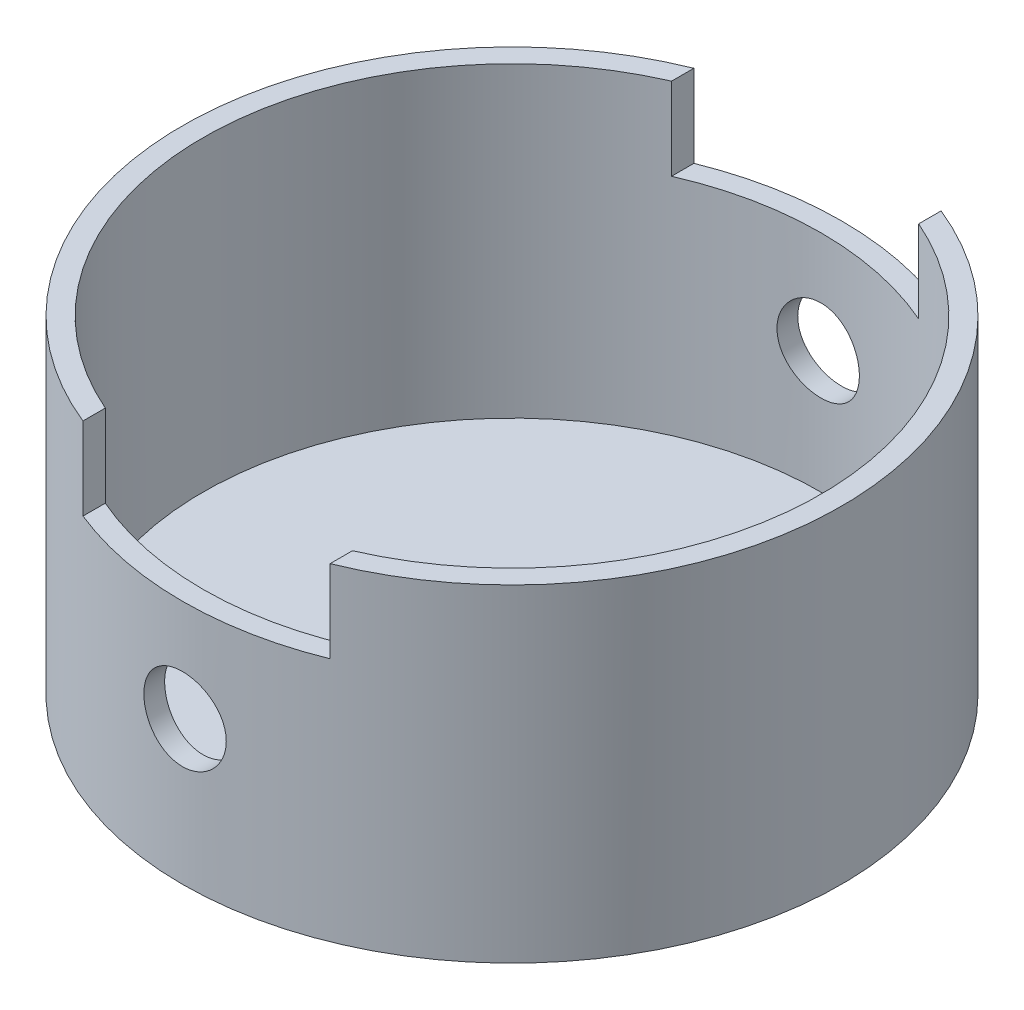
ISO-10303-21;
HEADER;
FILE_DESCRIPTION(('STEP AP214'),'2;1');
FILE_NAME('part.step','',(''),(''),'','','');
FILE_SCHEMA(('AUTOMOTIVE_DESIGN { 1 0 10303 214 1 1 1 1 }'));
ENDSEC;
DATA;
#1=APPLICATION_CONTEXT('core data for automotive mechanical design processes');
#2=APPLICATION_PROTOCOL_DEFINITION('international standard','automotive_design',2000,#1);
#3=PRODUCT_CONTEXT('',#1,'mechanical');
#4=PRODUCT('Part','Part','',(#3));
#5=PRODUCT_RELATED_PRODUCT_CATEGORY('part','',(#4));
#6=PRODUCT_DEFINITION_FORMATION('','',#4);
#7=PRODUCT_DEFINITION_CONTEXT('part definition',#1,'design');
#8=PRODUCT_DEFINITION('design','',#6,#7);
#9=PRODUCT_DEFINITION_SHAPE('','',#8);
#10=(LENGTH_UNIT() NAMED_UNIT(*) SI_UNIT(.MILLI.,.METRE.));
#11=(NAMED_UNIT(*) PLANE_ANGLE_UNIT() SI_UNIT($,.RADIAN.));
#12=(NAMED_UNIT(*) SI_UNIT($,.STERADIAN.) SOLID_ANGLE_UNIT());
#13=UNCERTAINTY_MEASURE_WITH_UNIT(LENGTH_MEASURE(1.E-05),#10,'distance_accuracy_value','');
#14=(GEOMETRIC_REPRESENTATION_CONTEXT(3) GLOBAL_UNCERTAINTY_ASSIGNED_CONTEXT((#13)) GLOBAL_UNIT_ASSIGNED_CONTEXT((#10,
#11,#12)) REPRESENTATION_CONTEXT('',''));
#15=CARTESIAN_POINT('',(0.,0.,0.));
#16=DIRECTION('',(0.,0.,1.));
#17=DIRECTION('',(1.,0.,0.));
#18=AXIS2_PLACEMENT_3D('',#15,#16,#17);
#19=CARTESIAN_POINT('',(0.,50.4952,0.));
#20=DIRECTION('',(0.,1.,0.));
#21=DIRECTION('',(0.,0.,1.));
#22=AXIS2_PLACEMENT_3D('',#19,#20,#21);
#23=PLANE('',#22);
#24=DIRECTION('',(0.,0.,1.));
#25=VECTOR('',#24,1.);
#26=CARTESIAN_POINT('',(-19.05,50.4952,-50.8));
#27=LINE('',#26,#25);
#28=CARTESIAN_POINT('',(-19.05,50.4952,-47.0928603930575));
#29=VERTEX_POINT('',#28);
#30=CARTESIAN_POINT('',(-19.05,50.4952,-43.6490334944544));
#31=VERTEX_POINT('',#30);
#32=EDGE_CURVE('E120',#29,#31,#27,.T.);
#33=ORIENTED_EDGE('',*,*,#32,.F.);
#34=CARTESIAN_POINT('',(0.,50.4952,0.));
#35=DIRECTION('',(0.,1.,0.));
#36=DIRECTION('',(0.,0.,1.));
#37=AXIS2_PLACEMENT_3D('',#34,#35,#36);
#38=CIRCLE('',#37,50.8);
#39=CARTESIAN_POINT('',(-19.05,50.4952,47.0928603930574));
#40=VERTEX_POINT('',#39);
#41=EDGE_CURVE('E158',#29,#40,#38,.T.);
#42=ORIENTED_EDGE('',*,*,#41,.T.);
#43=CARTESIAN_POINT('',(-19.05,50.4952,43.6490334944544));
#44=VERTEX_POINT('',#43);
#45=EDGE_CURVE('E198',#44,#40,#27,.T.);
#46=ORIENTED_EDGE('',*,*,#45,.F.);
#47=CARTESIAN_POINT('',(0.,50.4952,0.));
#48=DIRECTION('',(0.,1.,0.));
#49=DIRECTION('',(0.,0.,1.));
#50=AXIS2_PLACEMENT_3D('',#47,#48,#49);
#51=CIRCLE('',#50,47.625);
#52=EDGE_CURVE('E153',#31,#44,#51,.T.);
#53=ORIENTED_EDGE('',*,*,#52,.F.);
#54=EDGE_LOOP('',(#33,#42,#46,#53));
#55=FACE_BOUND('',#54,.T.);
#56=ADVANCED_FACE('F39',(#55),#23,.T.);
#57=CARTESIAN_POINT('',(0.,50.4952,0.));
#58=DIRECTION('',(0.,-1.,0.));
#59=DIRECTION('',(0.,0.,-1.));
#60=AXIS2_PLACEMENT_3D('',#57,#58,#59);
#61=CYLINDRICAL_SURFACE('',#60,50.8);
#62=CARTESIAN_POINT('',(0.,28.4226,-50.8));
#63=CARTESIAN_POINT('',(-0.177660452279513,28.4226020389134,-50.800000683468));
#64=CARTESIAN_POINT('',(-0.355290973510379,28.4151414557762,-50.7990661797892));
#65=CARTESIAN_POINT('',(-0.709338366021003,28.3853564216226,-50.7953557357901));
#66=CARTESIAN_POINT('',(-0.885754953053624,28.3630286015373,-50.7925793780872));
#67=CARTESIAN_POINT('',(-1.23618570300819,28.3036476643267,-50.7852595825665));
#68=CARTESIAN_POINT('',(-1.4101979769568,28.2665835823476,-50.780714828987));
#69=CARTESIAN_POINT('',(-1.75451712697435,28.1779895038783,-50.7699847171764));
#70=CARTESIAN_POINT('',(-1.92482262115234,28.1264542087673,-50.7637987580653));
#71=CARTESIAN_POINT('',(-2.26028082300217,28.0093633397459,-50.7499683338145));
#72=CARTESIAN_POINT('',(-2.42543874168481,27.943822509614,-50.7423254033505));
#73=CARTESIAN_POINT('',(-2.74969172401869,27.7991369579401,-50.7257879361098));
#74=CARTESIAN_POINT('',(-2.90878452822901,27.7199872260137,-50.7168929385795));
#75=CARTESIAN_POINT('',(-3.21964998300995,27.5487144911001,-50.6981073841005));
#76=CARTESIAN_POINT('',(-3.37142659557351,27.4565986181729,-50.6882173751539));
#77=CARTESIAN_POINT('',(-3.66675816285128,27.2599757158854,-50.667709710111));
#78=CARTESIAN_POINT('',(-3.81031004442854,27.1554640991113,-50.6570917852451));
#79=CARTESIAN_POINT('',(-4.08877364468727,26.9343061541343,-50.6353782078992));
#80=CARTESIAN_POINT('',(-4.22364310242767,26.8176068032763,-50.6242806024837));
#81=CARTESIAN_POINT('',(-4.48313482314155,26.5732418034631,-50.601961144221));
#82=CARTESIAN_POINT('',(-4.60775327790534,26.4455721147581,-50.5907392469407));
#83=CARTESIAN_POINT('',(-4.84578010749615,26.1802355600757,-50.5684951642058));
#84=CARTESIAN_POINT('',(-4.95919202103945,26.0425718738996,-50.5574729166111));
#85=CARTESIAN_POINT('',(-5.17409430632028,25.7581168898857,-50.5359319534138));
#86=CARTESIAN_POINT('',(-5.27558026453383,25.6113222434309,-50.5254134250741));
#87=CARTESIAN_POINT('',(-5.46614935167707,25.309218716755,-50.5051524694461));
#88=CARTESIAN_POINT('',(-5.55519426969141,25.1538855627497,-50.4954124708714));
#89=CARTESIAN_POINT('',(-5.71990676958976,24.8361494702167,-50.4770198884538));
#90=CARTESIAN_POINT('',(-5.79556937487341,24.6737439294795,-50.4683677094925));
#91=CARTESIAN_POINT('',(-5.93289692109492,24.3431168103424,-50.4524085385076));
#92=CARTESIAN_POINT('',(-5.99456744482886,24.1748975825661,-50.4451010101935));
#93=CARTESIAN_POINT('',(-6.10351153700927,23.8337833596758,-50.4320345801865));
#94=CARTESIAN_POINT('',(-6.15077981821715,23.6608866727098,-50.4262762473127));
#95=CARTESIAN_POINT('',(-6.26991974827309,23.1389812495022,-50.4116539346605));
#96=CARTESIAN_POINT('',(-6.32000152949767,22.7846432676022,-50.4053374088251));
#97=CARTESIAN_POINT('',(-6.36001442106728,22.0727333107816,-50.4003032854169));
#98=CARTESIAN_POINT('',(-6.34994795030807,21.7151614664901,-50.4015853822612));
#99=CARTESIAN_POINT('',(-6.2702829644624,21.0088500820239,-50.411557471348));
#100=CARTESIAN_POINT('',(-6.20102456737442,20.6600717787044,-50.4202051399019));
#101=CARTESIAN_POINT('',(-6.00545126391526,19.9791408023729,-50.4438714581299));
#102=CARTESIAN_POINT('',(-5.87913520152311,19.646988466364,-50.4588902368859));
#103=CARTESIAN_POINT('',(-5.57267217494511,19.007664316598,-50.4936536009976));
#104=CARTESIAN_POINT('',(-5.39237737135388,18.7005640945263,-50.5134111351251));
#105=CARTESIAN_POINT('',(-4.98317902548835,18.1208507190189,-50.555416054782));
#106=CARTESIAN_POINT('',(-4.75427325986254,17.8482391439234,-50.5776635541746));
#107=CARTESIAN_POINT('',(-4.25246571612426,17.3432655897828,-50.6223297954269));
#108=CARTESIAN_POINT('',(-3.97927069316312,17.1111949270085,-50.6447486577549));
#109=CARTESIAN_POINT('',(-3.39764921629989,16.6961594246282,-50.6870876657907));
#110=CARTESIAN_POINT('',(-3.08922268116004,16.5131946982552,-50.7070078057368));
#111=CARTESIAN_POINT('',(-2.44566864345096,16.2015644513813,-50.7421172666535));
#112=CARTESIAN_POINT('',(-2.1105322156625,16.0729171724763,-50.7573049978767));
#113=CARTESIAN_POINT('',(-1.42318216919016,15.8738049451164,-50.7812239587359));
#114=CARTESIAN_POINT('',(-1.07096935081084,15.8033372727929,-50.7899554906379));
#115=CARTESIAN_POINT('',(-0.361983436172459,15.7229621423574,-50.7999389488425));
#116=CARTESIAN_POINT('',(-0.00525650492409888,15.7126533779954,-50.8012404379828));
#117=CARTESIAN_POINT('',(0.704839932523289,15.751829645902,-50.796350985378));
#118=CARTESIAN_POINT('',(1.05820951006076,15.8013134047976,-50.7901602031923));
#119=CARTESIAN_POINT('',(1.75037625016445,15.9583366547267,-50.7710127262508));
#120=CARTESIAN_POINT('',(2.08921749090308,16.0656847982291,-50.7580783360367));
#121=CARTESIAN_POINT('',(2.74408812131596,16.3351907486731,-50.7268917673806));
#122=CARTESIAN_POINT('',(3.06011673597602,16.4973504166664,-50.7086394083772));
#123=CARTESIAN_POINT('',(3.66218349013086,16.8728468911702,-50.6687282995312));
#124=CARTESIAN_POINT('',(3.94805857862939,17.0864432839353,-50.6470524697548));
#125=CARTESIAN_POINT('',(4.48004432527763,17.5583840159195,-50.6027726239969));
#126=CARTESIAN_POINT('',(4.72615340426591,17.8167301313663,-50.580168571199));
#127=CARTESIAN_POINT('',(5.17304528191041,18.3725997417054,-50.5364268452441));
#128=CARTESIAN_POINT('',(5.37356206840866,18.6703378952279,-50.5152982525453));
#129=CARTESIAN_POINT('',(5.72173794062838,19.2955160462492,-50.4770495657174));
#130=CARTESIAN_POINT('',(5.86939808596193,19.6229554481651,-50.4599293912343));
#131=CARTESIAN_POINT('',(6.10724499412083,20.2973160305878,-50.4316957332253));
#132=CARTESIAN_POINT('',(6.19758172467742,20.6441837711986,-50.420566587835));
#133=CARTESIAN_POINT('',(6.31867625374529,21.3485092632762,-50.405537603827));
#134=CARTESIAN_POINT('',(6.34943682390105,21.7059665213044,-50.4016374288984));
#135=CARTESIAN_POINT('',(6.35026929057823,22.2406145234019,-50.401526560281));
#136=CARTESIAN_POINT('',(6.34308284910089,22.4180517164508,-50.402435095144));
#137=CARTESIAN_POINT('',(6.31389085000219,22.7716657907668,-50.4061013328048));
#138=CARTESIAN_POINT('',(6.29189081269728,22.9478431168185,-50.4088583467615));
#139=CARTESIAN_POINT('',(6.23321749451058,23.2977525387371,-50.4161467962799));
#140=CARTESIAN_POINT('',(6.1965388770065,23.4714837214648,-50.4206788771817));
#141=CARTESIAN_POINT('',(6.1087988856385,23.8151590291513,-50.4313843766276));
#142=CARTESIAN_POINT('',(6.05774274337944,23.9851045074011,-50.4375571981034));
#143=CARTESIAN_POINT('',(5.9416147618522,24.320073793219,-50.4513689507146));
#144=CARTESIAN_POINT('',(5.8765429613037,24.4850976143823,-50.4590078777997));
#145=CARTESIAN_POINT('',(5.73288012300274,24.8090144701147,-50.475531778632));
#146=CARTESIAN_POINT('',(5.65429399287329,24.9679097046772,-50.4844162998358));
#147=CARTESIAN_POINT('',(5.48411509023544,25.27858877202,-50.5031861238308));
#148=CARTESIAN_POINT('',(5.39251755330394,25.4303699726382,-50.5130717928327));
#149=CARTESIAN_POINT('',(5.19701859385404,25.7256590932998,-50.5335596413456));
#150=CARTESIAN_POINT('',(5.09312159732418,25.8691699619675,-50.5441615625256));
#151=CARTESIAN_POINT('',(4.87294741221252,26.1479719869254,-50.5658649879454));
#152=CARTESIAN_POINT('',(4.7565881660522,26.2831981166,-50.5769694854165));
#153=CARTESIAN_POINT('',(4.5129587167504,26.5433324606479,-50.5992900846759));
#154=CARTESIAN_POINT('',(4.38569248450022,26.6682443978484,-50.6105061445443));
#155=CARTESIAN_POINT('',(4.12101889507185,26.9070065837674,-50.6327447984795));
#156=CARTESIAN_POINT('',(3.98360546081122,27.0208501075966,-50.6437672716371));
#157=CARTESIAN_POINT('',(3.6997147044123,27.2365500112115,-50.6652974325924));
#158=CARTESIAN_POINT('',(3.55324074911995,27.3384108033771,-50.675805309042));
#159=CARTESIAN_POINT('',(3.25157211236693,27.5298728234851,-50.6960572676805));
#160=CARTESIAN_POINT('',(3.09634349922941,27.6194209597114,-50.7057979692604));
#161=CARTESIAN_POINT('',(2.77888304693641,27.7850735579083,-50.7241863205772));
#162=CARTESIAN_POINT('',(2.6166538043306,27.8611829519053,-50.7328343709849));
#163=CARTESIAN_POINT('',(2.28641311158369,27.9993887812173,-50.7487892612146));
#164=CARTESIAN_POINT('',(2.11840629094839,28.0614961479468,-50.7560971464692));
#165=CARTESIAN_POINT('',(1.77774856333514,28.171299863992,-50.7691705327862));
#166=CARTESIAN_POINT('',(1.60509876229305,28.2189996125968,-50.7749363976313));
#167=CARTESIAN_POINT('',(1.1964522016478,28.313494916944,-50.7864482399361));
#168=CARTESIAN_POINT('',(0.959041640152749,28.3543672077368,-50.7915088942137));
#169=CARTESIAN_POINT('',(0.481069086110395,28.4089182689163,-50.7982842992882));
#170=CARTESIAN_POINT('',(0.240507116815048,28.4225972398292,-50.799999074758));
#171=CARTESIAN_POINT('',(0.,28.4226,-50.8));
#172=B_SPLINE_CURVE_WITH_KNOTS('',3,(#62,#63,#64,#65,#66,#67,#68,#69,#70,#71,#72,#73,#74,#75,
#76,#77,#78,#79,#80,#81,#82,#83,#84,#85,#86,#87,#88,#89,#90,#91,#92,#93,#94,#95,#96,#97,#98,#99,
#100,#101,#102,#103,#104,#105,#106,#107,#108,#109,#110,#111,#112,#113,#114,#115,#116,#117,#118,
#119,#120,#121,#122,#123,#124,#125,#126,#127,#128,#129,#130,#131,#132,#133,#134,#135,#136,#137,
#138,#139,#140,#141,#142,#143,#144,#145,#146,#147,#148,#149,#150,#151,#152,#153,#154,#155,#156,
#157,#158,#159,#160,#161,#162,#163,#164,#165,#166,#167,#168,#169,#170,#171),.UNSPECIFIED.,.T.,
.F.,(4,2,2,2,2,2,2,2,2,2,2,2,2,2,2,2,2,2,2,2,2,2,2,2,2,2,2,2,2,2,2,2,2,2,2,2,2,2,2,2,2,2,2,2,2,
2,2,2,2,2,2,2,2,2,4),(0.,0.532770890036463,1.06566255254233,1.59895146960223,2.13243590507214,
2.66536147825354,3.19848368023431,3.73131385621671,4.26434184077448,4.79979383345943,
5.33544385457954,5.87092418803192,6.40660207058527,6.94389065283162,7.48137862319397,
8.0186517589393,8.55612189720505,9.6242791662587,10.6923934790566,11.7544113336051,
12.8164507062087,13.8814258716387,14.9464497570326,16.0188371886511,17.0912270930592,
18.1639768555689,19.2366763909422,20.3022119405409,21.3677247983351,22.4297356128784,
23.4917824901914,24.5593058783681,25.6268716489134,26.7005149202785,27.7741366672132,
28.8449379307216,29.915689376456,30.4479262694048,30.9799649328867,31.512197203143,
32.0442360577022,32.5762734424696,33.1081180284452,33.640157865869,34.1720068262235,
34.7076024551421,35.243003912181,35.7787286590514,36.314255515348,36.8520236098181,
37.3895939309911,37.9267431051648,38.4637654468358,39.1850071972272,39.9062436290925),.UNSPECIFIED.);
#173=CARTESIAN_POINT('',(0.,28.4226,-50.8));
#174=VERTEX_POINT('',#173);
#175=EDGE_CURVE('E142',#174,#174,#172,.T.);
#176=ORIENTED_EDGE('',*,*,#175,.T.);
#177=EDGE_LOOP('',(#176));
#178=FACE_BOUND('',#177,.T.);
#179=CARTESIAN_POINT('',(6.35,22.0726,50.4015624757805));
#180=CARTESIAN_POINT('',(6.35000203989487,21.8949456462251,50.4015617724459));
#181=CARTESIAN_POINT('',(6.34254196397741,21.7173212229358,50.4025036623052));
#182=CARTESIAN_POINT('',(6.312759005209,21.3632861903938,50.4062427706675));
#183=CARTESIAN_POINT('',(6.2904327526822,21.1868758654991,50.4090404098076));
#184=CARTESIAN_POINT('',(6.23105610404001,20.8364577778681,50.4164142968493));
#185=CARTESIAN_POINT('',(6.19399473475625,20.6624519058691,50.4209918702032));
#186=CARTESIAN_POINT('',(6.10540735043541,20.3181456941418,50.4317954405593));
#187=CARTESIAN_POINT('',(6.0538760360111,20.1478467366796,50.4380220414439));
#188=CARTESIAN_POINT('',(5.93679478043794,19.8124024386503,50.4519368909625));
#189=CARTESIAN_POINT('',(5.87125966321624,19.6472518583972,50.459623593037));
#190=CARTESIAN_POINT('',(5.72658692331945,19.3230129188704,50.476246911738));
#191=CARTESIAN_POINT('',(5.64744429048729,19.1639268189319,50.4851839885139));
#192=CARTESIAN_POINT('',(5.47618683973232,18.8530735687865,50.5040472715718));
#193=CARTESIAN_POINT('',(5.38407914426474,18.7013024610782,50.5139729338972));
#194=CARTESIAN_POINT('',(5.18747334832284,18.4059803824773,50.5345415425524));
#195=CARTESIAN_POINT('',(5.08297066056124,18.2624324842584,50.5451847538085));
#196=CARTESIAN_POINT('',(4.8618216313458,17.9839633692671,50.5669367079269));
#197=CARTESIAN_POINT('',(4.74512128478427,17.8490851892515,50.5780473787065));
#198=CARTESIAN_POINT('',(4.50075244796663,17.5895759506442,50.6003782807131));
#199=CARTESIAN_POINT('',(4.37307991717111,17.4649487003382,50.6115985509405));
#200=CARTESIAN_POINT('',(4.10773593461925,17.2269046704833,50.6338248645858));
#201=CARTESIAN_POINT('',(3.9700676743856,17.1134843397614,50.6448309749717));
#202=CARTESIAN_POINT('',(3.68560182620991,16.8985658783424,50.6663269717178));
#203=CARTESIAN_POINT('',(3.53880088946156,16.7970721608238,50.6768166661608));
#204=CARTESIAN_POINT('',(3.23669240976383,16.6064943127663,50.6970097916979));
#205=CARTESIAN_POINT('',(3.08136107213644,16.5174476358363,50.7067108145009));
#206=CARTESIAN_POINT('',(2.76362847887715,16.3527314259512,50.7250203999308));
#207=CARTESIAN_POINT('',(2.60122462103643,16.277066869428,50.733628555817));
#208=CARTESIAN_POINT('',(2.27060093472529,16.1397352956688,50.7494996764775));
#209=CARTESIAN_POINT('',(2.10238345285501,16.078062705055,50.7567631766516));
#210=CARTESIAN_POINT('',(1.76127307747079,15.9691143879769,50.7697464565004));
#211=CARTESIAN_POINT('',(1.58837849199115,15.9218439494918,50.775465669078));
#212=CARTESIAN_POINT('',(1.06648254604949,15.8026978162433,50.7899854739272));
#213=CARTESIAN_POINT('',(0.712152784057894,15.7526112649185,50.7962529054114));
#214=CARTESIAN_POINT('',(0.000258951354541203,15.7125859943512,50.8012493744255));
#215=CARTESIAN_POINT('',(-0.357304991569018,15.7226449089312,50.7999787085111));
#216=CARTESIAN_POINT('',(-1.06364943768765,15.8022978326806,50.7900842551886));
#217=CARTESIAN_POINT('',(-1.41246781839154,15.8715593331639,50.7815015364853));
#218=CARTESIAN_POINT('',(-2.09347734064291,16.0671526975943,50.7579900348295));
#219=CARTESIAN_POINT('',(-2.42566816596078,16.1934856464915,50.7430611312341));
#220=CARTESIAN_POINT('',(-3.06503935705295,16.499983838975,50.7084648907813));
#221=CARTESIAN_POINT('',(-3.37215002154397,16.6802930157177,50.6887849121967));
#222=CARTESIAN_POINT('',(-3.95187820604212,17.0895221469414,50.6468880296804));
#223=CARTESIAN_POINT('',(-4.22449414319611,17.3184443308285,50.6246710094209));
#224=CARTESIAN_POINT('',(-4.72944952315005,17.8202636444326,50.5800072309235));
#225=CARTESIAN_POINT('',(-4.96150095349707,18.0934506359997,50.5575599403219));
#226=CARTESIAN_POINT('',(-5.3765014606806,18.6750491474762,50.5151154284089));
#227=CARTESIAN_POINT('',(-5.55945038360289,18.9834607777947,50.4951182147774));
#228=CARTESIAN_POINT('',(-5.87106921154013,19.627010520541,50.459838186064));
#229=CARTESIAN_POINT('',(-5.99971604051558,19.9621599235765,50.4445573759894));
#230=CARTESIAN_POINT('',(-6.19882340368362,20.6495382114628,50.4204793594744));
#231=CARTESIAN_POINT('',(-6.26928674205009,21.0017662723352,50.4116818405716));
#232=CARTESIAN_POINT('',(-6.34964549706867,21.7107596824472,50.4016235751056));
#233=CARTESIAN_POINT('',(-6.3599462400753,22.0674784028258,50.4003123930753));
#234=CARTESIAN_POINT('',(-6.32075685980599,22.7775565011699,50.4052418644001));
#235=CARTESIAN_POINT('',(-6.27126801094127,23.1309159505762,50.4114823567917));
#236=CARTESIAN_POINT('',(-6.11424555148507,23.8230302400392,50.4307660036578));
#237=CARTESIAN_POINT('',(-6.00690820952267,24.1618303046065,50.4437861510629));
#238=CARTESIAN_POINT('',(-5.73743762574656,24.8166233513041,50.4751433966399));
#239=CARTESIAN_POINT('',(-5.57530245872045,25.1326155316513,50.4934806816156));
#240=CARTESIAN_POINT('',(-5.19984241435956,25.7346568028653,50.5335268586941));
#241=CARTESIAN_POINT('',(-4.98625173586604,26.0205389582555,50.5552530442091));
#242=CARTESIAN_POINT('',(-4.51431819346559,26.552541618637,50.5995746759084));
#243=CARTESIAN_POINT('',(-4.25597358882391,26.7986605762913,50.622170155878));
#244=CARTESIAN_POINT('',(-3.70009980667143,27.2455747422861,50.6658394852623));
#245=CARTESIAN_POINT('',(-3.40235567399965,27.4461036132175,50.6869039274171));
#246=CARTESIAN_POINT('',(-2.77716225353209,27.7943006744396,50.7249965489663));
#247=CARTESIAN_POINT('',(-2.44971356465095,27.9419699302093,50.7420248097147));
#248=CARTESIAN_POINT('',(-1.77535807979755,28.1798226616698,50.7700866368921));
#249=CARTESIAN_POINT('',(-1.42850612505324,28.2701600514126,50.781136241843));
#250=CARTESIAN_POINT('',(-0.724214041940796,28.3912612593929,50.7960550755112));
#251=CARTESIAN_POINT('',(-0.366774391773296,28.4220277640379,50.7999246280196));
#252=CARTESIAN_POINT('',(0.167870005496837,28.4228734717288,50.8000360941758));
#253=CARTESIAN_POINT('',(0.345320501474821,28.4156903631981,50.799135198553));
#254=CARTESIAN_POINT('',(0.698961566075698,28.3865027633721,50.7954979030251));
#255=CARTESIAN_POINT('',(0.875152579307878,28.3645037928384,50.7927621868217));
#256=CARTESIAN_POINT('',(1.22508958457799,28.305830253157,50.785527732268));
#257=CARTESIAN_POINT('',(1.39883466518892,28.269150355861,50.7810283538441));
#258=CARTESIAN_POINT('',(1.74253780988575,28.1814053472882,50.7703959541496));
#259=CARTESIAN_POINT('',(1.9124972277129,28.1303454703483,50.7642635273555));
#260=CARTESIAN_POINT('',(2.24749546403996,28.014207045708,50.7505356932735));
#261=CARTESIAN_POINT('',(2.41253425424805,27.9491284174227,50.7429402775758));
#262=CARTESIAN_POINT('',(2.7364800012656,27.80544935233,50.72650168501));
#263=CARTESIAN_POINT('',(2.89538915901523,27.7268538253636,50.7176589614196));
#264=CARTESIAN_POINT('',(3.2060943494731,27.5566539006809,50.6989663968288));
#265=CARTESIAN_POINT('',(3.3578877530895,27.4650447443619,50.6891161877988));
#266=CARTESIAN_POINT('',(3.65319907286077,27.2695207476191,50.6686889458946));
#267=CARTESIAN_POINT('',(3.79671993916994,27.1656103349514,50.6581121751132));
#268=CARTESIAN_POINT('',(4.07552183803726,26.9454218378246,50.6364474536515));
#269=CARTESIAN_POINT('',(4.21073899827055,26.8290631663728,50.625356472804));
#270=CARTESIAN_POINT('',(4.47085530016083,26.5854367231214,50.6030482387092));
#271=CARTESIAN_POINT('',(4.59575816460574,26.4581729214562,50.5918310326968));
#272=CARTESIAN_POINT('',(4.83450252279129,26.193505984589,50.5695755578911));
#273=CARTESIAN_POINT('',(4.94833728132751,26.0560967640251,50.5585374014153));
#274=CARTESIAN_POINT('',(5.16402028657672,25.7722161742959,50.5369631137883));
#275=CARTESIAN_POINT('',(5.26587294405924,25.6257481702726,50.526426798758));
#276=CARTESIAN_POINT('',(5.45732534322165,25.3240840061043,50.5061076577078));
#277=CARTESIAN_POINT('',(5.54687124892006,25.1688534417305,50.4963282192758));
#278=CARTESIAN_POINT('',(5.71251918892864,24.8513892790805,50.4778572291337));
#279=CARTESIAN_POINT('',(5.78862615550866,24.6891582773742,50.4691652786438));
#280=CARTESIAN_POINT('',(5.92682699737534,24.3589140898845,50.453122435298));
#281=CARTESIAN_POINT('',(5.98893181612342,24.1909055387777,50.4457704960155));
#282=CARTESIAN_POINT('',(6.09873035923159,23.850244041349,50.4326138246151));
#283=CARTESIAN_POINT('',(6.14642748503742,23.6775922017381,50.4268087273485));
#284=CARTESIAN_POINT('',(6.24091158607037,23.2689613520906,50.4152165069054));
#285=CARTESIAN_POINT('',(6.28177759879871,23.0315689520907,50.4101181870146));
#286=CARTESIAN_POINT('',(6.33632032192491,22.5536327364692,50.4032916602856));
#287=CARTESIAN_POINT('',(6.34999723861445,22.313088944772,50.4015634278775));
#288=CARTESIAN_POINT('',(6.35,22.0726,50.4015624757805));
#289=B_SPLINE_CURVE_WITH_KNOTS('',3,(#179,#180,#181,#182,#183,#184,#185,#186,#187,#188,#189,
#190,#191,#192,#193,#194,#195,#196,#197,#198,#199,#200,#201,#202,#203,#204,#205,#206,#207,#208,
#209,#210,#211,#212,#213,#214,#215,#216,#217,#218,#219,#220,#221,#222,#223,#224,#225,#226,#227,
#228,#229,#230,#231,#232,#233,#234,#235,#236,#237,#238,#239,#240,#241,#242,#243,#244,#245,#246,
#247,#248,#249,#250,#251,#252,#253,#254,#255,#256,#257,#258,#259,#260,#261,#262,#263,#264,#265,
#266,#267,#268,#269,#270,#271,#272,#273,#274,#275,#276,#277,#278,#279,#280,#281,#282,#283,#284,
#285,#286,#287,#288),.UNSPECIFIED.,.T.,.F.,(4,2,2,2,2,2,2,2,2,2,2,2,2,2,2,2,2,2,2,2,2,2,2,2,2,2,
2,2,2,2,2,2,2,2,2,2,2,2,2,2,2,2,2,2,2,2,2,2,2,2,2,2,2,2,4),(0.,0.53275257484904,
1.06562594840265,1.59889689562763,2.13236340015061,2.66526796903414,3.19836917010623,
3.73117864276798,4.26418592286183,4.79966199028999,5.33533610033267,5.87083992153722,
6.406541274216,6.94382138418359,7.4813008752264,8.01856589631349,8.55602794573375,
9.62416161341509,10.6922532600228,11.7543851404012,12.8165372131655,13.8815472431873,
14.9466061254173,16.0189443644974,17.0912859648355,18.1640828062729,19.2368279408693,
20.3023373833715,21.3678241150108,22.4297184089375,23.4916500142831,24.5591894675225,
25.6267704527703,26.7004365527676,27.7740810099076,28.8448308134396,29.9155323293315,
30.4478085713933,30.9798865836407,31.5121578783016,32.0442356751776,32.5763165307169,
33.108204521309,33.6402875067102,34.1721795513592,34.7077512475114,35.2431287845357,
35.778830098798,36.3143335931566,36.8521097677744,37.3896881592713,37.9268449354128,
38.463874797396,39.1850621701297,39.9062440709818),.UNSPECIFIED.);
#290=CARTESIAN_POINT('',(6.35,22.0726,50.4015624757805));
#291=VERTEX_POINT('',#290);
#292=EDGE_CURVE('E191',#291,#291,#289,.T.);
#293=ORIENTED_EDGE('',*,*,#292,.T.);
#294=EDGE_LOOP('',(#293));
#295=FACE_BOUND('',#294,.T.);
#296=CARTESIAN_POINT('',(19.05,50.4952,47.0928603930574));
#297=VERTEX_POINT('',#296);
#298=CARTESIAN_POINT('',(19.05,50.4952,-47.0928603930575));
#299=VERTEX_POINT('',#298);
#300=EDGE_CURVE('E161',#297,#299,#38,.T.);
#301=ORIENTED_EDGE('',*,*,#300,.F.);
#302=DIRECTION('',(0.,-1.,0.));
#303=VECTOR('',#302,1.);
#304=CARTESIAN_POINT('',(19.05,50.4952,47.0928603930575));
#305=LINE('',#304,#303);
#306=CARTESIAN_POINT('',(19.05,37.7952,47.0928603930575));
#307=VERTEX_POINT('',#306);
#308=EDGE_CURVE('E129',#297,#307,#305,.T.);
#309=ORIENTED_EDGE('',*,*,#308,.T.);
#310=CARTESIAN_POINT('',(0.,37.7952,0.));
#311=DIRECTION('',(0.,-1.,0.));
#312=DIRECTION('',(1.,0.,0.));
#313=AXIS2_PLACEMENT_3D('',#310,#311,#312);
#314=CIRCLE('',#313,50.8);
#315=CARTESIAN_POINT('',(-19.05,37.7952,47.0928603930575));
#316=VERTEX_POINT('',#315);
#317=EDGE_CURVE('E119',#307,#316,#314,.T.);
#318=ORIENTED_EDGE('',*,*,#317,.T.);
#319=DIRECTION('',(0.,-1.,0.));
#320=VECTOR('',#319,1.);
#321=CARTESIAN_POINT('',(-19.05,50.4952,47.0928603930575));
#322=LINE('',#321,#320);
#323=EDGE_CURVE('E146',#316,#40,#322,.F.);
#324=ORIENTED_EDGE('',*,*,#323,.T.);
#325=ORIENTED_EDGE('',*,*,#41,.F.);
#326=DIRECTION('',(0.,-1.,0.));
#327=VECTOR('',#326,1.);
#328=CARTESIAN_POINT('',(-19.05,50.4952,-47.0928603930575));
#329=LINE('',#328,#327);
#330=CARTESIAN_POINT('',(-19.05,37.7952,-47.0928603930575));
#331=VERTEX_POINT('',#330);
#332=EDGE_CURVE('E117',#29,#331,#329,.T.);
#333=ORIENTED_EDGE('',*,*,#332,.T.);
#334=CARTESIAN_POINT('',(19.05,37.7952,-47.0928603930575));
#335=VERTEX_POINT('',#334);
#336=EDGE_CURVE('E110',#331,#335,#314,.T.);
#337=ORIENTED_EDGE('',*,*,#336,.T.);
#338=DIRECTION('',(0.,-1.,0.));
#339=VECTOR('',#338,1.);
#340=CARTESIAN_POINT('',(19.05,50.4952,-47.0928603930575));
#341=LINE('',#340,#339);
#342=EDGE_CURVE('E114',#335,#299,#341,.F.);
#343=ORIENTED_EDGE('',*,*,#342,.T.);
#344=EDGE_LOOP('',(#301,#309,#318,#324,#325,#333,#337,#343));
#345=FACE_BOUND('',#344,.T.);
#346=CARTESIAN_POINT('',(0.,0.,0.));
#347=DIRECTION('',(0.,1.,0.));
#348=DIRECTION('',(0.,0.,1.));
#349=AXIS2_PLACEMENT_3D('',#346,#347,#348);
#350=CIRCLE('',#349,50.8);
#351=CARTESIAN_POINT('',(0.,0.,50.8));
#352=VERTEX_POINT('',#351);
#353=EDGE_CURVE('E157',#352,#352,#350,.T.);
#354=ORIENTED_EDGE('',*,*,#353,.T.);
#355=EDGE_LOOP('',(#354));
#356=FACE_BOUND('',#355,.T.);
#357=ADVANCED_FACE('F41',(#178,#295,#345,#356),#61,.T.);
#358=DIRECTION('',(0.,0.,1.));
#359=VECTOR('',#358,1.);
#360=CARTESIAN_POINT('',(19.05,50.4952,-50.8));
#361=LINE('',#360,#359);
#362=CARTESIAN_POINT('',(19.05,50.4952,43.6490334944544));
#363=VERTEX_POINT('',#362);
#364=EDGE_CURVE('E134',#363,#297,#361,.T.);
#365=ORIENTED_EDGE('',*,*,#364,.T.);
#366=ORIENTED_EDGE('',*,*,#300,.T.);
#367=CARTESIAN_POINT('',(19.05,50.4952,-43.6490334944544));
#368=VERTEX_POINT('',#367);
#369=EDGE_CURVE('E128',#299,#368,#361,.T.);
#370=ORIENTED_EDGE('',*,*,#369,.T.);
#371=EDGE_CURVE('E154',#363,#368,#51,.T.);
#372=ORIENTED_EDGE('',*,*,#371,.F.);
#373=EDGE_LOOP('',(#365,#366,#370,#372));
#374=FACE_BOUND('',#373,.T.);
#375=ADVANCED_FACE('F204',(#374),#23,.T.);
#376=CARTESIAN_POINT('',(0.,0.,0.));
#377=DIRECTION('',(0.,1.,0.));
#378=DIRECTION('',(0.,0.,1.));
#379=AXIS2_PLACEMENT_3D('',#376,#377,#378);
#380=PLANE('',#379);
#381=ORIENTED_EDGE('',*,*,#353,.F.);
#382=EDGE_LOOP('',(#381));
#383=FACE_BOUND('',#382,.T.);
#384=ADVANCED_FACE('F231',(#383),#380,.F.);
#385=CARTESIAN_POINT('',(0.,50.4952,0.));
#386=DIRECTION('',(0.,-1.,0.));
#387=DIRECTION('',(0.,0.,-1.));
#388=AXIS2_PLACEMENT_3D('',#385,#386,#387);
#389=CYLINDRICAL_SURFACE('',#388,47.625);
#390=CARTESIAN_POINT('',(0.,28.4226,-47.625));
#391=CARTESIAN_POINT('',(-0.177558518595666,28.4226021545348,-47.6250007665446));
#392=CARTESIAN_POINT('',(-0.355085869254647,28.4151500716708,-47.6240050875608));
#393=CARTESIAN_POINT('',(-0.708926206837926,28.3853997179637,-47.6200518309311));
#394=CARTESIAN_POINT('',(-0.885238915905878,28.3630981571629,-47.6170938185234));
#395=CARTESIAN_POINT('',(-1.2354576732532,28.3037888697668,-47.6092950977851));
#396=CARTESIAN_POINT('',(-1.40936188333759,28.2667704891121,-47.604453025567));
#397=CARTESIAN_POINT('',(-1.75346548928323,28.1782881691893,-47.59302080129));
#398=CARTESIAN_POINT('',(-1.92366350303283,28.1268189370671,-47.5864300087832));
#399=CARTESIAN_POINT('',(-2.25890477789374,28.0098831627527,-47.5716943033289));
#400=CARTESIAN_POINT('',(-2.4239533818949,27.944431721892,-47.5635510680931));
#401=CARTESIAN_POINT('',(-2.7479935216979,27.7999477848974,-47.545930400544));
#402=CARTESIAN_POINT('',(-2.9069827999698,27.7209102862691,-47.5364524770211));
#403=CARTESIAN_POINT('',(-3.21765252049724,27.5498837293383,-47.5164346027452));
#404=CARTESIAN_POINT('',(-3.36933685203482,27.4579016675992,-47.5058952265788));
#405=CARTESIAN_POINT('',(-3.66449805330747,27.2615674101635,-47.4840393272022));
#406=CARTESIAN_POINT('',(-3.80797185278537,27.1572106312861,-47.4727225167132));
#407=CARTESIAN_POINT('',(-4.08638849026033,26.9363096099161,-47.449569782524));
#408=CARTESIAN_POINT('',(-4.22128309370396,26.8197048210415,-47.4377314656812));
#409=CARTESIAN_POINT('',(-4.48083474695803,26.5755300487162,-47.4139192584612));
#410=CARTESIAN_POINT('',(-4.60548799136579,26.4479560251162,-47.4019453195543));
#411=CARTESIAN_POINT('',(-4.84359640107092,26.1828084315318,-47.3782071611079));
#412=CARTESIAN_POINT('',(-4.95705507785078,26.0452380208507,-47.3664428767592));
#413=CARTESIAN_POINT('',(-5.17206375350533,25.760963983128,-47.3434481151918));
#414=CARTESIAN_POINT('',(-5.27360934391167,25.6142570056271,-47.3322178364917));
#415=CARTESIAN_POINT('',(-5.46435706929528,25.3122465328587,-47.310576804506));
#416=CARTESIAN_POINT('',(-5.55351485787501,25.1569148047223,-47.3001690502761));
#417=CARTESIAN_POINT('',(-5.71845174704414,24.8391628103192,-47.2805122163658));
#418=CARTESIAN_POINT('',(-5.79422586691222,24.6767399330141,-47.2712635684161));
#419=CARTESIAN_POINT('',(-5.93177189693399,24.3460595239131,-47.2542011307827));
#420=CARTESIAN_POINT('',(-5.99354944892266,24.1778043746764,-47.2463867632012));
#421=CARTESIAN_POINT('',(-6.10270025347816,23.8366000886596,-47.2324110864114));
#422=CARTESIAN_POINT('',(-6.15006822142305,23.6636492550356,-47.2262503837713));
#423=CARTESIAN_POINT('',(-6.26943342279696,23.1418056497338,-47.2106090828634));
#424=CARTESIAN_POINT('',(-6.31966706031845,22.787569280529,-47.2038441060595));
#425=CARTESIAN_POINT('',(-6.36000928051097,22.0758283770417,-47.1984244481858));
#426=CARTESIAN_POINT('',(-6.35012060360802,21.7183239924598,-47.1997693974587));
#427=CARTESIAN_POINT('',(-6.27086611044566,21.0124147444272,-47.210363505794));
#428=CARTESIAN_POINT('',(-6.2018880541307,20.6639657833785,-47.2195611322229));
#429=CARTESIAN_POINT('',(-6.0069972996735,19.9836467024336,-47.2447475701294));
#430=CARTESIAN_POINT('',(-5.88108330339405,19.6517769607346,-47.2607365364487));
#431=CARTESIAN_POINT('',(-5.57548790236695,19.0128229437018,-47.2977611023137));
#432=CARTESIAN_POINT('',(-5.39563929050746,18.7058195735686,-47.3188123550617));
#433=CARTESIAN_POINT('',(-4.98739783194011,18.1262046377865,-47.3635779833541));
#434=CARTESIAN_POINT('',(-4.75900246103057,17.8535948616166,-47.3872924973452));
#435=CARTESIAN_POINT('',(-4.25800803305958,17.3482540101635,-47.4349413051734));
#436=CARTESIAN_POINT('',(-3.98507491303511,17.1158540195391,-47.4588758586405));
#437=CARTESIAN_POINT('',(-3.40389899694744,16.7001124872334,-47.5040935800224));
#438=CARTESIAN_POINT('',(-3.09565609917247,16.5167710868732,-47.5253767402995));
#439=CARTESIAN_POINT('',(-2.45234529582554,16.204345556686,-47.5629095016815));
#440=CARTESIAN_POINT('',(-2.11726646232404,16.0752836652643,-47.5791570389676));
#441=CARTESIAN_POINT('',(-1.42992768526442,15.8753514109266,-47.6047697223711));
#442=CARTESIAN_POINT('',(-1.07766865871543,15.8044779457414,-47.6141352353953));
#443=CARTESIAN_POINT('',(-0.368829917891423,15.7233669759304,-47.6248806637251));
#444=CARTESIAN_POINT('',(-0.0123032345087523,15.7126736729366,-47.6263206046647));
#445=CARTESIAN_POINT('',(0.697457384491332,15.7510215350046,-47.6212151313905));
#446=CARTESIAN_POINT('',(1.05069139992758,15.8000612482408,-47.6146699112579));
#447=CARTESIAN_POINT('',(1.74248354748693,15.9561042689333,-47.5943668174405));
#448=CARTESIAN_POINT('',(2.08109190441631,16.0628887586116,-47.5806361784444));
#449=CARTESIAN_POINT('',(2.73559618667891,16.3311616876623,-47.5474985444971));
#450=CARTESIAN_POINT('',(3.05149124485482,16.4926522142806,-47.5280913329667));
#451=CARTESIAN_POINT('',(3.65362769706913,16.8668450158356,-47.4856123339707));
#452=CARTESIAN_POINT('',(3.93968548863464,17.0798403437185,-47.4625198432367));
#453=CARTESIAN_POINT('',(4.47215557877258,17.5505853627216,-47.4153143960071));
#454=CARTESIAN_POINT('',(4.71856607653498,17.8083370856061,-47.3912013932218));
#455=CARTESIAN_POINT('',(5.16637754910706,18.3632881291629,-47.344485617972));
#456=CARTESIAN_POINT('',(5.36747529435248,18.6607331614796,-47.3218936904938));
#457=CARTESIAN_POINT('',(5.71685225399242,19.2854602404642,-47.2809613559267));
#458=CARTESIAN_POINT('',(5.86513264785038,19.6127416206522,-47.2626208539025));
#459=CARTESIAN_POINT('',(6.10418777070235,20.2868289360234,-47.2323412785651));
#460=CARTESIAN_POINT('',(6.19512986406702,20.6335747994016,-47.2203835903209));
#461=CARTESIAN_POINT('',(6.31744023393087,21.3377830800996,-47.2041793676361));
#462=CARTESIAN_POINT('',(6.34881169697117,21.6952449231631,-47.1999324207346));
#463=CARTESIAN_POINT('',(6.35054214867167,22.2298017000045,-47.1996932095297));
#464=CARTESIAN_POINT('',(6.34366545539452,22.4071051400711,-47.2006216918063));
#465=CARTESIAN_POINT('',(6.31511544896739,22.7604773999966,-47.2044510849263));
#466=CARTESIAN_POINT('',(6.29344765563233,22.93654665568,-47.2073512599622));
#467=CARTESIAN_POINT('',(6.23545997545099,23.2862658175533,-47.2150453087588));
#468=CARTESIAN_POINT('',(6.19913477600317,23.459914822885,-47.2198398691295));
#469=CARTESIAN_POINT('',(6.11212140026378,23.8034531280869,-47.2311816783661));
#470=CARTESIAN_POINT('',(6.06143843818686,23.9733437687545,-47.2377282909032));
#471=CARTESIAN_POINT('',(5.94608196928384,24.3082137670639,-47.2523873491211));
#472=CARTESIAN_POINT('',(5.88141005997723,24.4731936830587,-47.2604996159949));
#473=CARTESIAN_POINT('',(5.73856686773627,24.7970561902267,-47.2780567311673));
#474=CARTESIAN_POINT('',(5.66040047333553,24.9559409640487,-47.2875010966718));
#475=CARTESIAN_POINT('',(5.49107821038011,25.2666370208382,-47.3074618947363));
#476=CARTESIAN_POINT('',(5.39991752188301,25.4184456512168,-47.3179787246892));
#477=CARTESIAN_POINT('',(5.2053055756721,25.7138312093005,-47.3397824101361));
#478=CARTESIAN_POINT('',(5.10185872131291,25.8574110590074,-47.3510689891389));
#479=CARTESIAN_POINT('',(4.88249533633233,26.1365261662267,-47.374192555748));
#480=CARTESIAN_POINT('',(4.76648598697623,26.2719881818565,-47.3860332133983));
#481=CARTESIAN_POINT('',(4.52353914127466,26.5326247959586,-47.409841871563));
#482=CARTESIAN_POINT('',(4.39660561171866,26.6578030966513,-47.4218098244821));
#483=CARTESIAN_POINT('',(4.13257607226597,26.8971290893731,-47.4455478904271));
#484=CARTESIAN_POINT('',(3.99547398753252,27.0112700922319,-47.4573178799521));
#485=CARTESIAN_POINT('',(3.71217897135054,27.2275955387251,-47.4803173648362));
#486=CARTESIAN_POINT('',(3.56598941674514,27.3297843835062,-47.4915470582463));
#487=CARTESIAN_POINT('',(3.26478068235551,27.5219827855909,-47.5132058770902));
#488=CARTESIAN_POINT('',(3.10972320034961,27.6119327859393,-47.5236309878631));
#489=CARTESIAN_POINT('',(2.79256156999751,27.7784010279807,-47.5433219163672));
#490=CARTESIAN_POINT('',(2.63046003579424,27.8549242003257,-47.5525881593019));
#491=CARTESIAN_POINT('',(2.30042686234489,27.9939655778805,-47.5696955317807));
#492=CARTESIAN_POINT('',(2.13249979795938,28.0564944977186,-47.5775377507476));
#493=CARTESIAN_POINT('',(1.79195617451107,28.1671427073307,-47.5915809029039));
#494=CARTESIAN_POINT('',(1.61934071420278,28.2152653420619,-47.5977822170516));
#495=CARTESIAN_POINT('',(1.20846765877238,28.3112732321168,-47.6102521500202));
#496=CARTESIAN_POINT('',(0.968715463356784,28.3529766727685,-47.6157589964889));
#497=CARTESIAN_POINT('',(0.485956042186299,28.4086384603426,-47.6231323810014));
#498=CARTESIAN_POINT('',(0.242948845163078,28.4225970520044,-47.6249989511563));
#499=CARTESIAN_POINT('',(0.,28.4226,-47.625));
#500=B_SPLINE_CURVE_WITH_KNOTS('',3,(#390,#391,#392,#393,#394,#395,#396,#397,#398,#399,#400,
#401,#402,#403,#404,#405,#406,#407,#408,#409,#410,#411,#412,#413,#414,#415,#416,#417,#418,#419,
#420,#421,#422,#423,#424,#425,#426,#427,#428,#429,#430,#431,#432,#433,#434,#435,#436,#437,#438,
#439,#440,#441,#442,#443,#444,#445,#446,#447,#448,#449,#450,#451,#452,#453,#454,#455,#456,#457,
#458,#459,#460,#461,#462,#463,#464,#465,#466,#467,#468,#469,#470,#471,#472,#473,#474,#475,#476,
#477,#478,#479,#480,#481,#482,#483,#484,#485,#486,#487,#488,#489,#490,#491,#492,#493,#494,#495,
#496,#497,#498,#499),.UNSPECIFIED.,.T.,.F.,(4,2,2,2,2,2,2,2,2,2,2,2,2,2,2,2,2,2,2,2,2,2,2,2,2,2,
2,2,2,2,2,2,2,2,2,2,2,2,2,2,2,2,2,2,2,2,2,2,2,2,2,2,2,2,4),(0.,0.532462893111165,
1.06504379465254,1.59801095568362,2.13117357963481,2.66376325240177,3.19654945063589,
3.72904877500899,4.26174593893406,4.79721281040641,5.33287775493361,5.86837413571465,
6.40406805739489,6.94163281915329,7.47939721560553,8.01694445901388,8.55468860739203,
9.62262583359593,10.6905143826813,11.7514483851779,12.8124065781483,13.8766885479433,
14.9410258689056,16.013748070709,17.0864733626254,18.1596377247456,19.2327448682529,
20.297713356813,21.3626559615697,22.4235910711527,23.4845666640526,24.5517272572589,
25.6189363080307,26.6930879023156,27.7672155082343,28.8381931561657,29.9091135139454,
30.4409132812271,30.9725146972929,31.5043089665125,32.0359103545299,32.567451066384,
33.0987996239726,33.6303457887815,34.1617020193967,34.6972934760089,35.2326912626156,
35.7684115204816,36.3039338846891,36.8419755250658,37.3798191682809,37.9172495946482,
38.4545551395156,39.1831171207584,39.911672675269),.UNSPECIFIED.);
#501=CARTESIAN_POINT('',(0.,28.4226,-47.625));
#502=VERTEX_POINT('',#501);
#503=EDGE_CURVE('E44',#502,#502,#500,.T.);
#504=ORIENTED_EDGE('',*,*,#503,.F.);
#505=EDGE_LOOP('',(#504));
#506=FACE_BOUND('',#505,.T.);
#507=CARTESIAN_POINT('',(6.35,22.0726,47.1997682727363));
#508=CARTESIAN_POINT('',(6.35000215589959,21.8950493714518,47.1997674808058));
#509=CARTESIAN_POINT('',(6.34255072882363,21.717529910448,47.200772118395));
#510=CARTESIAN_POINT('',(6.31280305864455,21.3637055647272,47.2047601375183));
#511=CARTESIAN_POINT('',(6.2905035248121,21.187400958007,47.2077439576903));
#512=CARTESIAN_POINT('',(6.23119978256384,20.8371985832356,47.2156082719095));
#513=CARTESIAN_POINT('',(6.19418490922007,20.6633026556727,47.2204901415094));
#514=CARTESIAN_POINT('',(6.1057112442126,20.3192157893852,47.2320114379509));
#515=CARTESIAN_POINT('',(6.05424715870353,20.1490262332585,47.2386515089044));
#516=CARTESIAN_POINT('',(5.9373238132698,19.8138029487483,47.253489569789));
#517=CARTESIAN_POINT('',(5.87187975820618,19.6487638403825,47.2616858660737));
#518=CARTESIAN_POINT('',(5.72741238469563,19.3247418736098,47.279410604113));
#519=CARTESIAN_POINT('',(5.64838406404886,19.1657612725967,47.2889395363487));
#520=CARTESIAN_POINT('',(5.47737726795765,18.8551073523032,47.3090516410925));
#521=CARTESIAN_POINT('',(5.38540577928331,18.7034301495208,47.3196342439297));
#522=CARTESIAN_POINT('',(5.18909364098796,18.4082812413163,47.3415640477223));
#523=CARTESIAN_POINT('',(5.08474840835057,18.2648126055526,47.3529115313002));
#524=CARTESIAN_POINT('',(4.8638589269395,17.9863888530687,47.3761110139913));
#525=CARTESIAN_POINT('',(4.74725286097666,17.8514829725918,47.3879653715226));
#526=CARTESIAN_POINT('',(4.50307314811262,17.5919086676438,47.4117918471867));
#527=CARTESIAN_POINT('',(4.37549546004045,17.467244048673,47.4237640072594));
#528=CARTESIAN_POINT('',(4.11033828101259,17.2291133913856,47.4474809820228));
#529=CARTESIAN_POINT('',(3.97276196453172,17.1156438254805,47.4592258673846));
#530=CARTESIAN_POINT('',(3.68847389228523,16.9006142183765,47.4821663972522));
#531=CARTESIAN_POINT('',(3.54175878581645,16.7990585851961,47.4933618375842));
#532=CARTESIAN_POINT('',(3.23974188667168,16.6082995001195,47.5149206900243));
#533=CARTESIAN_POINT('',(3.08441248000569,16.5191394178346,47.5252811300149));
#534=CARTESIAN_POINT('',(2.76666495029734,16.3541976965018,47.5448371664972));
#535=CARTESIAN_POINT('',(2.60424421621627,16.2784210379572,47.5540323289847));
#536=CARTESIAN_POINT('',(2.27356817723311,16.1408697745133,47.5709877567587));
#537=CARTESIAN_POINT('',(2.10531524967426,16.0790895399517,47.5787485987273));
#538=CARTESIAN_POINT('',(1.76411586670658,15.9699332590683,47.5926231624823));
#539=CARTESIAN_POINT('',(1.591167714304,15.9225624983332,47.5987362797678));
#540=CARTESIAN_POINT('',(1.06933640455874,15.8031893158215,47.6142529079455));
#541=CARTESIAN_POINT('',(0.715110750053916,15.7529495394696,47.6209581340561));
#542=CARTESIAN_POINT('',(0.00339088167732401,15.7125913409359,47.6263318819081));
#543=CARTESIAN_POINT('',(-0.354103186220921,15.7224702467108,47.6250007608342));
#544=CARTESIAN_POINT('',(-1.06005505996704,15.8017090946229,47.6145008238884));
#545=CARTESIAN_POINT('',(-1.40855581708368,15.8706911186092,47.6053818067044));
#546=CARTESIAN_POINT('',(-2.08897643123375,16.0656076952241,47.580382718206));
#547=CARTESIAN_POINT('',(-2.42089593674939,16.1915434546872,47.5645025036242));
#548=CARTESIAN_POINT('',(-3.0599109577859,16.4971842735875,47.5276804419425));
#549=CARTESIAN_POINT('',(-3.36692799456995,16.6770515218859,47.5067233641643));
#550=CARTESIAN_POINT('',(-3.94656239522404,17.0853329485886,47.4620891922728));
#551=CARTESIAN_POINT('',(-4.21917796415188,17.3137496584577,47.4384119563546));
#552=CARTESIAN_POINT('',(-4.72449537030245,17.8147594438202,47.3907671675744));
#553=CARTESIAN_POINT('',(-4.95687041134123,18.0876821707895,47.3667987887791));
#554=CARTESIAN_POINT('',(-5.37256652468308,18.6688283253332,47.3214540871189));
#555=CARTESIAN_POINT('',(-5.55588740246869,18.9770518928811,47.3000777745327));
#556=CARTESIAN_POINT('',(-5.86829807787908,19.62035700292,47.2623380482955));
#557=CARTESIAN_POINT('',(-5.9973593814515,19.9554525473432,47.245977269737));
#558=CARTESIAN_POINT('',(-6.1972853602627,20.6428277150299,47.220170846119));
#559=CARTESIAN_POINT('',(-6.26815324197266,20.9951063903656,47.2107248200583));
#560=CARTESIAN_POINT('',(-6.34924310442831,21.7039549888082,47.1998879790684));
#561=CARTESIAN_POINT('',(-6.35992603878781,22.0604712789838,47.1984359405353));
#562=CARTESIAN_POINT('',(-6.32156114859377,22.7702086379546,47.2035893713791));
#563=CARTESIAN_POINT('',(-6.27251477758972,23.1234297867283,47.2101946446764));
#564=CARTESIAN_POINT('',(-6.11647256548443,23.8151542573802,47.2306624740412));
#565=CARTESIAN_POINT('',(-6.00970194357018,24.1537092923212,47.2444968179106));
#566=CARTESIAN_POINT('',(-5.74147456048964,24.8081130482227,47.2778410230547));
#567=CARTESIAN_POINT('',(-5.58001562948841,25.12396086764,47.2973511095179));
#568=CARTESIAN_POINT('',(-5.20586998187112,25.7260639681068,47.3399944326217));
#569=CARTESIAN_POINT('',(-4.99288220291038,26.0121306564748,47.3631486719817));
#570=CARTESIAN_POINT('',(-4.52214688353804,26.5446222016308,47.4104062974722));
#571=CARTESIAN_POINT('',(-4.26439735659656,26.7910452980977,47.4345097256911));
#572=CARTESIAN_POINT('',(-3.70944106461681,27.2388856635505,47.4811391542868));
#573=CARTESIAN_POINT('',(-3.41198814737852,27.4399992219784,47.5036538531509));
#574=CARTESIAN_POINT('',(-2.7872409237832,27.789403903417,47.5443974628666));
#575=CARTESIAN_POINT('',(-2.45994728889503,27.9376962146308,47.5626264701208));
#576=CARTESIAN_POINT('',(-1.78586635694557,28.1767588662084,47.5926969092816));
#577=CARTESIAN_POINT('',(-1.43914097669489,28.2677017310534,47.6045574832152));
#578=CARTESIAN_POINT('',(-0.734976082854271,28.3900205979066,47.6206267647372));
#579=CARTESIAN_POINT('',(-0.377537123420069,28.4213996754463,47.6248358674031));
#580=CARTESIAN_POINT('',(0.157014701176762,28.4231472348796,47.625074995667));
#581=CARTESIAN_POINT('',(0.334335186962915,28.4162748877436,47.6241555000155));
#582=CARTESIAN_POINT('',(0.687742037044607,28.3877306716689,47.6203606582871));
#583=CARTESIAN_POINT('',(0.863828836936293,28.3660643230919,47.6174860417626));
#584=CARTESIAN_POINT('',(1.21358336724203,28.3080765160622,47.6098569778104));
#585=CARTESIAN_POINT('',(1.38725019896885,28.2717497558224,47.6051018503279));
#586=CARTESIAN_POINT('',(1.7308242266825,28.1847301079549,47.5938483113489));
#587=CARTESIAN_POINT('',(1.90073276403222,28.1340424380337,47.5873505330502));
#588=CARTESIAN_POINT('',(2.23564024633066,28.0186726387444,47.5727930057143));
#589=CARTESIAN_POINT('',(2.40063968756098,27.9539919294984,47.5647334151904));
#590=CARTESIAN_POINT('',(2.7245399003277,27.8111277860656,47.5472796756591));
#591=CARTESIAN_POINT('',(2.88344285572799,27.7329492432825,47.5378860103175));
#592=CARTESIAN_POINT('',(3.19417305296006,27.5635997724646,47.5180190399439));
#593=CARTESIAN_POINT('',(3.34599764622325,27.4724240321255,47.5075453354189));
#594=CARTESIAN_POINT('',(3.64141227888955,27.2777796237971,47.4858154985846));
#595=CARTESIAN_POINT('',(3.78500524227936,27.1743153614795,47.4745596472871));
#596=CARTESIAN_POINT('',(4.06412043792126,26.9549333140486,47.4514838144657));
#597=CARTESIAN_POINT('',(4.19957091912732,26.8389246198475,47.4396601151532));
#598=CARTESIAN_POINT('',(4.46018431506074,26.5959814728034,47.4158676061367));
#599=CARTESIAN_POINT('',(4.58535093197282,26.4690509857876,47.4038988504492));
#600=CARTESIAN_POINT('',(4.82465394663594,26.2050298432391,47.380141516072));
#601=CARTESIAN_POINT('',(4.93878364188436,26.0679331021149,47.3683530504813));
#602=CARTESIAN_POINT('',(5.15508726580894,25.7846510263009,47.3453010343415));
#603=CARTESIAN_POINT('',(5.25726559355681,25.6384690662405,47.3340372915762));
#604=CARTESIAN_POINT('',(5.44945143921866,25.3372661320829,47.3122976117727));
#605=CARTESIAN_POINT('',(5.53939845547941,25.1822062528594,47.3018256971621));
#606=CARTESIAN_POINT('',(5.70586049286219,24.8650401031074,47.2820347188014));
#607=CARTESIAN_POINT('',(5.78238044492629,24.7029364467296,47.2727152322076));
#608=CARTESIAN_POINT('',(5.92141523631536,24.372899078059,47.2555010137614));
#609=CARTESIAN_POINT('',(5.98394080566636,24.2049699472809,47.247605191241));
#610=CARTESIAN_POINT('',(6.09458224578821,23.8644218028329,47.2334605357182));
#611=CARTESIAN_POINT('',(6.14270146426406,23.6918038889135,47.2272113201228));
#612=CARTESIAN_POINT('',(6.23869482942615,23.2809511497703,47.2146425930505));
#613=CARTESIAN_POINT('',(6.28039013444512,23.0412222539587,47.2090891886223));
#614=CARTESIAN_POINT('',(6.33604111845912,22.5585094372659,47.2016525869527));
#615=CARTESIAN_POINT('',(6.34999705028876,22.3155255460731,47.199769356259));
#616=CARTESIAN_POINT('',(6.35,22.0726,47.1997682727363));
#617=B_SPLINE_CURVE_WITH_KNOTS('',3,(#507,#508,#509,#510,#511,#512,#513,#514,#515,#516,#517,
#518,#519,#520,#521,#522,#523,#524,#525,#526,#527,#528,#529,#530,#531,#532,#533,#534,#535,#536,
#537,#538,#539,#540,#541,#542,#543,#544,#545,#546,#547,#548,#549,#550,#551,#552,#553,#554,#555,
#556,#557,#558,#559,#560,#561,#562,#563,#564,#565,#566,#567,#568,#569,#570,#571,#572,#573,#574,
#575,#576,#577,#578,#579,#580,#581,#582,#583,#584,#585,#586,#587,#588,#589,#590,#591,#592,#593,
#594,#595,#596,#597,#598,#599,#600,#601,#602,#603,#604,#605,#606,#607,#608,#609,#610,#611,#612,
#613,#614,#615,#616),.UNSPECIFIED.,.T.,.F.,(4,2,2,2,2,2,2,2,2,2,2,2,2,2,2,2,2,2,2,2,2,2,2,2,2,2,
2,2,2,2,2,2,2,2,2,2,2,2,2,2,2,2,2,2,2,2,2,2,2,2,2,2,2,2,4),(0.,0.532439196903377,
1.06499643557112,1.59794035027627,2.13107977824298,2.66364228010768,3.19640131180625,
3.72887385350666,4.26154423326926,4.79704225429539,5.33273836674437,5.86826513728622,
6.40398942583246,6.94154331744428,7.47929683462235,8.01683367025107,8.55456744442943,
9.62247387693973,10.6903328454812,11.751414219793,12.812518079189,13.8768455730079,
14.9412285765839,16.0138868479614,17.0865493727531,18.1597744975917,19.2329404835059,
20.2978758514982,21.3627853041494,22.4235695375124,23.4843958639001,24.551576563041,
25.6188046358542,26.692986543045,27.7671442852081,28.8380550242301,29.9089104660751,
30.4407606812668,30.9724125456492,31.5042568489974,32.0359081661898,32.5675055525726,
33.0989106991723,33.6305131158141,34.1619255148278,34.6974861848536,35.232853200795,
35.7685433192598,36.3040356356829,36.8420872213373,37.3799407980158,37.9173805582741,
38.4546953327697,39.1831876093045,39.9116732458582),.UNSPECIFIED.);
#618=CARTESIAN_POINT('',(6.35,22.0726,47.1997682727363));
#619=VERTEX_POINT('',#618);
#620=EDGE_CURVE('E170',#619,#619,#617,.T.);
#621=ORIENTED_EDGE('',*,*,#620,.F.);
#622=EDGE_LOOP('',(#621));
#623=FACE_BOUND('',#622,.T.);
#624=DIRECTION('',(0.,-1.,0.));
#625=VECTOR('',#624,1.);
#626=CARTESIAN_POINT('',(-19.05,50.4952,43.6490334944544));
#627=LINE('',#626,#625);
#628=CARTESIAN_POINT('',(-19.05,37.7952,43.6490334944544));
#629=VERTEX_POINT('',#628);
#630=EDGE_CURVE('E11',#629,#44,#627,.F.);
#631=ORIENTED_EDGE('',*,*,#630,.F.);
#632=CARTESIAN_POINT('',(0.,37.7952,0.));
#633=DIRECTION('',(0.,-1.,0.));
#634=DIRECTION('',(1.,0.,0.));
#635=AXIS2_PLACEMENT_3D('',#632,#633,#634);
#636=CIRCLE('',#635,47.625);
#637=CARTESIAN_POINT('',(19.05,37.7952,43.6490334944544));
#638=VERTEX_POINT('',#637);
#639=EDGE_CURVE('E166',#638,#629,#636,.T.);
#640=ORIENTED_EDGE('',*,*,#639,.F.);
#641=DIRECTION('',(0.,-1.,0.));
#642=VECTOR('',#641,1.);
#643=CARTESIAN_POINT('',(19.05,50.4952,43.6490334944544));
#644=LINE('',#643,#642);
#645=EDGE_CURVE('E53',#363,#638,#644,.T.);
#646=ORIENTED_EDGE('',*,*,#645,.F.);
#647=ORIENTED_EDGE('',*,*,#371,.T.);
#648=DIRECTION('',(0.,-1.,0.));
#649=VECTOR('',#648,1.);
#650=CARTESIAN_POINT('',(19.05,50.4952,-43.6490334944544));
#651=LINE('',#650,#649);
#652=CARTESIAN_POINT('',(19.05,37.7952,-43.6490334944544));
#653=VERTEX_POINT('',#652);
#654=EDGE_CURVE('E165',#653,#368,#651,.F.);
#655=ORIENTED_EDGE('',*,*,#654,.F.);
#656=CARTESIAN_POINT('',(-19.05,37.7952,-43.6490334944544));
#657=VERTEX_POINT('',#656);
#658=EDGE_CURVE('E133',#657,#653,#636,.T.);
#659=ORIENTED_EDGE('',*,*,#658,.F.);
#660=DIRECTION('',(0.,-1.,0.));
#661=VECTOR('',#660,1.);
#662=CARTESIAN_POINT('',(-19.05,50.4952,-43.6490334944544));
#663=LINE('',#662,#661);
#664=EDGE_CURVE('E168',#31,#657,#663,.T.);
#665=ORIENTED_EDGE('',*,*,#664,.F.);
#666=ORIENTED_EDGE('',*,*,#52,.T.);
#667=EDGE_LOOP('',(#631,#640,#646,#647,#655,#659,#665,#666));
#668=FACE_BOUND('',#667,.T.);
#669=CARTESIAN_POINT('',(0.,3.175,0.));
#670=DIRECTION('',(0.,1.,0.));
#671=DIRECTION('',(0.,0.,1.));
#672=AXIS2_PLACEMENT_3D('',#669,#670,#671);
#673=CIRCLE('',#672,47.625);
#674=CARTESIAN_POINT('',(0.,3.175,47.625));
#675=VERTEX_POINT('',#674);
#676=EDGE_CURVE('E150',#675,#675,#673,.T.);
#677=ORIENTED_EDGE('',*,*,#676,.F.);
#678=EDGE_LOOP('',(#677));
#679=FACE_BOUND('',#678,.T.);
#680=ADVANCED_FACE('F174',(#506,#623,#668,#679),#389,.F.);
#681=CARTESIAN_POINT('',(0.,3.175,0.));
#682=DIRECTION('',(0.,1.,0.));
#683=DIRECTION('',(0.,0.,1.));
#684=AXIS2_PLACEMENT_3D('',#681,#682,#683);
#685=PLANE('',#684);
#686=ORIENTED_EDGE('',*,*,#676,.T.);
#687=EDGE_LOOP('',(#686));
#688=FACE_BOUND('',#687,.T.);
#689=ADVANCED_FACE('F221',(#688),#685,.T.);
#690=CARTESIAN_POINT('',(-19.05,37.7952,-50.8));
#691=DIRECTION('',(0.,-1.,0.));
#692=DIRECTION('',(1.,0.,0.));
#693=AXIS2_PLACEMENT_3D('',#690,#691,#692);
#694=PLANE('',#693);
#695=DIRECTION('',(0.,0.,1.));
#696=VECTOR('',#695,1.);
#697=CARTESIAN_POINT('',(-19.05,37.7952,-50.8));
#698=LINE('',#697,#696);
#699=EDGE_CURVE('E69',#331,#657,#698,.T.);
#700=ORIENTED_EDGE('',*,*,#699,.T.);
#701=ORIENTED_EDGE('',*,*,#658,.T.);
#702=DIRECTION('',(0.,0.,1.));
#703=VECTOR('',#702,1.);
#704=CARTESIAN_POINT('',(19.05,37.7952,-50.8));
#705=LINE('',#704,#703);
#706=EDGE_CURVE('E125',#335,#653,#705,.T.);
#707=ORIENTED_EDGE('',*,*,#706,.F.);
#708=ORIENTED_EDGE('',*,*,#336,.F.);
#709=EDGE_LOOP('',(#700,#701,#707,#708));
#710=FACE_BOUND('',#709,.T.);
#711=ADVANCED_FACE('F131',(#710),#694,.F.);
#712=CARTESIAN_POINT('',(19.05,50.4952,-50.8));
#713=DIRECTION('',(1.,0.,0.));
#714=DIRECTION('',(0.,1.,0.));
#715=AXIS2_PLACEMENT_3D('',#712,#713,#714);
#716=PLANE('',#715);
#717=ORIENTED_EDGE('',*,*,#706,.T.);
#718=ORIENTED_EDGE('',*,*,#654,.T.);
#719=ORIENTED_EDGE('',*,*,#369,.F.);
#720=ORIENTED_EDGE('',*,*,#342,.F.);
#721=EDGE_LOOP('',(#717,#718,#719,#720));
#722=FACE_BOUND('',#721,.T.);
#723=ADVANCED_FACE('F124',(#722),#716,.F.);
#724=CARTESIAN_POINT('',(-19.05,50.4952,-50.8));
#725=DIRECTION('',(-1.,0.,0.));
#726=DIRECTION('',(0.,-1.,0.));
#727=AXIS2_PLACEMENT_3D('',#724,#725,#726);
#728=PLANE('',#727);
#729=ORIENTED_EDGE('',*,*,#32,.T.);
#730=ORIENTED_EDGE('',*,*,#664,.T.);
#731=ORIENTED_EDGE('',*,*,#699,.F.);
#732=ORIENTED_EDGE('',*,*,#332,.F.);
#733=EDGE_LOOP('',(#729,#730,#731,#732));
#734=FACE_BOUND('',#733,.T.);
#735=ADVANCED_FACE('F267',(#734),#728,.F.);
#736=EDGE_CURVE('E140',#629,#316,#698,.T.);
#737=ORIENTED_EDGE('',*,*,#736,.F.);
#738=ORIENTED_EDGE('',*,*,#630,.T.);
#739=ORIENTED_EDGE('',*,*,#45,.T.);
#740=ORIENTED_EDGE('',*,*,#323,.F.);
#741=EDGE_LOOP('',(#737,#738,#739,#740));
#742=FACE_BOUND('',#741,.T.);
#743=ADVANCED_FACE('F212',(#742),#728,.F.);
#744=ORIENTED_EDGE('',*,*,#364,.F.);
#745=ORIENTED_EDGE('',*,*,#645,.T.);
#746=EDGE_CURVE('E61',#638,#307,#705,.T.);
#747=ORIENTED_EDGE('',*,*,#746,.T.);
#748=ORIENTED_EDGE('',*,*,#308,.F.);
#749=EDGE_LOOP('',(#744,#745,#747,#748));
#750=FACE_BOUND('',#749,.T.);
#751=ADVANCED_FACE('F184',(#750),#716,.F.);
#752=ORIENTED_EDGE('',*,*,#746,.F.);
#753=ORIENTED_EDGE('',*,*,#639,.T.);
#754=ORIENTED_EDGE('',*,*,#736,.T.);
#755=ORIENTED_EDGE('',*,*,#317,.F.);
#756=EDGE_LOOP('',(#752,#753,#754,#755));
#757=FACE_BOUND('',#756,.T.);
#758=ADVANCED_FACE('F213',(#757),#694,.F.);
#759=CARTESIAN_POINT('',(0.,22.0726,-50.8));
#760=DIRECTION('',(0.,0.,1.));
#761=DIRECTION('',(1.,0.,0.));
#762=AXIS2_PLACEMENT_3D('',#759,#760,#761);
#763=CYLINDRICAL_SURFACE('',#762,6.35);
#764=ORIENTED_EDGE('',*,*,#620,.T.);
#765=EDGE_LOOP('',(#764));
#766=FACE_BOUND('',#765,.T.);
#767=ORIENTED_EDGE('',*,*,#292,.F.);
#768=EDGE_LOOP('',(#767));
#769=FACE_BOUND('',#768,.T.);
#770=ADVANCED_FACE('F182',(#766,#769),#763,.F.);
#771=ORIENTED_EDGE('',*,*,#503,.T.);
#772=EDGE_LOOP('',(#771));
#773=FACE_BOUND('',#772,.T.);
#774=ORIENTED_EDGE('',*,*,#175,.F.);
#775=EDGE_LOOP('',(#774));
#776=FACE_BOUND('',#775,.T.);
#777=ADVANCED_FACE('F178',(#773,#776),#763,.F.);
#778=CLOSED_SHELL('',(#56,#357,#375,#384,#680,#689,#711,#723,#735,#743,#751,#758,#770,#777));
#779=MANIFOLD_SOLID_BREP('B2',#778);
#780=ADVANCED_BREP_SHAPE_REPRESENTATION('',(#18,#779),#14);
#781=SHAPE_DEFINITION_REPRESENTATION(#9,#780);
ENDSEC;
END-ISO-10303-21;
